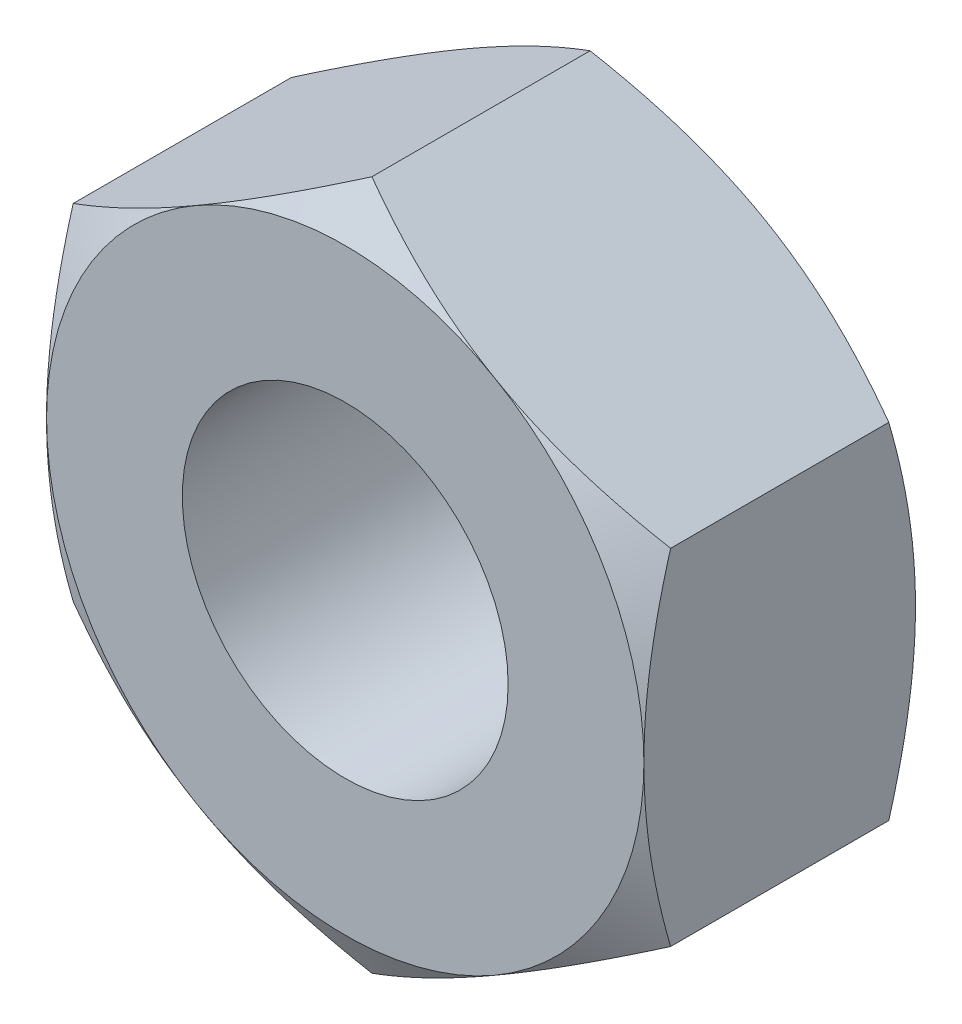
from build123d import *

# Parameters (mm, degrees)
BASE_EXTRUSION_DEPTH    = 5
ESQUISSE3_R             = 3
ENL_V_MAT_EXTRU_1_DEPTH = 10.776672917


with BuildPart() as part:
    # Esquisse1 → Base-Extrusion (new body)
    with BuildSketch(Plane.XY):
        Polygon((5.5, -3.175426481), (5.5, 3.175426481), (0, 6.350852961), (-5.5, 3.175426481), (-5.5, -3.175426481), (0, -6.350852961), align=None)
    extrude(amount=-BASE_EXTRUSION_DEPTH)

    # Esquisse2 → Enl_vement de mati_re-R_volution1 (revolve, cut)
    with BuildSketch(Plane(origin=(0, 0, 0), x_dir=(1, 0, 0), z_dir=(0, 1, 0)), mode=Mode.PRIVATE) as enl_vement_de_mati_re_r_volution1_sk:
        Polygon((-5.5, 0), (-10.830127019, 0), (-10.830127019, 5), (-5.5, 5), (-9.830127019, 2.5), align=None)
    revolve(enl_vement_de_mati_re_r_volution1_sk.sketch.rotate(Axis((0, 0, -5), (0, 0, 1)), 180), axis=Axis((0, 0, -5), (0, 0, 1)), mode=Mode.SUBTRACT)

    # Esquisse3 → Enl_v. mat.-Extru.1 (cut, through all)
    with BuildSketch(Plane.XY):
        Circle(ESQUISSE3_R)
    extrude(amount=-ENL_V_MAT_EXTRU_1_DEPTH, mode=Mode.SUBTRACT)


solid = part.part
